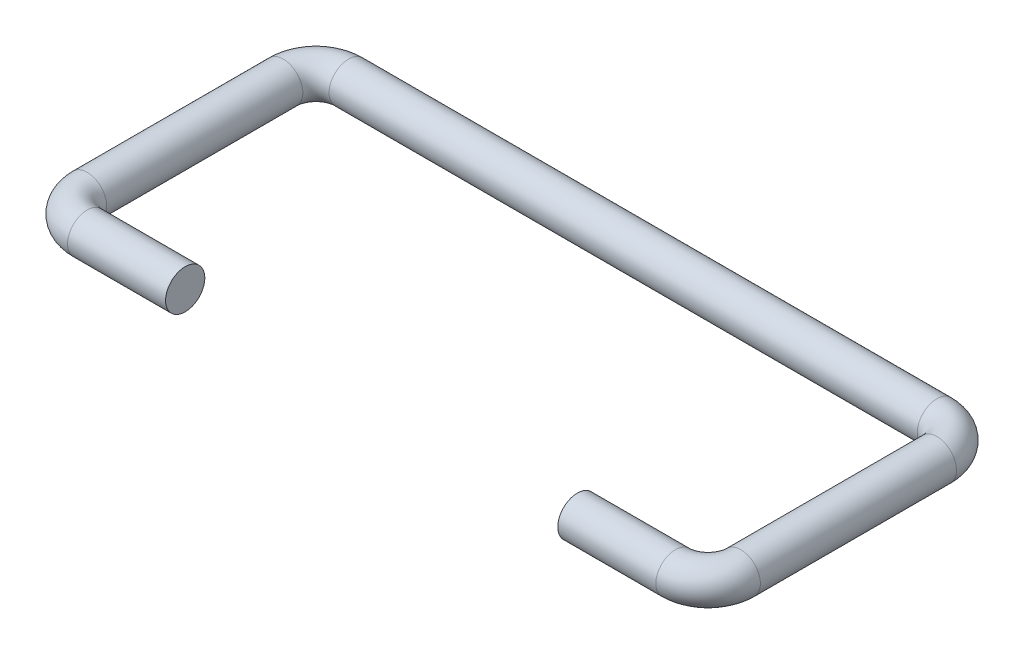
ISO-10303-21;
HEADER;
FILE_DESCRIPTION(('STEP AP214'),'2;1');
FILE_NAME('part.step','',(''),(''),'','','');
FILE_SCHEMA(('AUTOMOTIVE_DESIGN { 1 0 10303 214 1 1 1 1 }'));
ENDSEC;
DATA;
#1=APPLICATION_CONTEXT('core data for automotive mechanical design processes');
#2=APPLICATION_PROTOCOL_DEFINITION('international standard','automotive_design',2000,#1);
#3=PRODUCT_CONTEXT('',#1,'mechanical');
#4=PRODUCT('Part','Part','',(#3));
#5=PRODUCT_RELATED_PRODUCT_CATEGORY('part','',(#4));
#6=PRODUCT_DEFINITION_FORMATION('','',#4);
#7=PRODUCT_DEFINITION_CONTEXT('part definition',#1,'design');
#8=PRODUCT_DEFINITION('design','',#6,#7);
#9=PRODUCT_DEFINITION_SHAPE('','',#8);
#10=(LENGTH_UNIT() NAMED_UNIT(*) SI_UNIT(.MILLI.,.METRE.));
#11=(NAMED_UNIT(*) PLANE_ANGLE_UNIT() SI_UNIT($,.RADIAN.));
#12=(NAMED_UNIT(*) SI_UNIT($,.STERADIAN.) SOLID_ANGLE_UNIT());
#13=UNCERTAINTY_MEASURE_WITH_UNIT(LENGTH_MEASURE(1.E-05),#10,'distance_accuracy_value','');
#14=(GEOMETRIC_REPRESENTATION_CONTEXT(3) GLOBAL_UNCERTAINTY_ASSIGNED_CONTEXT((#13)) GLOBAL_UNIT_ASSIGNED_CONTEXT((#10,
#11,#12)) REPRESENTATION_CONTEXT('',''));
#15=CARTESIAN_POINT('',(0.,0.,0.));
#16=DIRECTION('',(0.,0.,1.));
#17=DIRECTION('',(1.,0.,0.));
#18=AXIS2_PLACEMENT_3D('',#15,#16,#17);
#19=CARTESIAN_POINT('',(45.,0.,0.));
#20=DIRECTION('',(-1.,0.,0.));
#21=DIRECTION('',(0.,0.,1.));
#22=AXIS2_PLACEMENT_3D('',#19,#20,#21);
#23=CYLINDRICAL_SURFACE('',#22,3.);
#24=CARTESIAN_POINT('',(-30.,0.,0.));
#25=DIRECTION('',(-1.,0.,0.));
#26=DIRECTION('',(0.,0.,1.));
#27=AXIS2_PLACEMENT_3D('',#24,#25,#26);
#28=CIRCLE('',#27,3.);
#29=CARTESIAN_POINT('',(-30.,0.,3.));
#30=VERTEX_POINT('',#29);
#31=EDGE_CURVE('E37',#30,#30,#28,.T.);
#32=ORIENTED_EDGE('',*,*,#31,.T.);
#33=EDGE_LOOP('',(#32));
#34=FACE_BOUND('',#33,.T.);
#35=CARTESIAN_POINT('',(-45.,0.,0.));
#36=DIRECTION('',(1.,0.,0.));
#37=DIRECTION('',(0.,0.,-1.));
#38=AXIS2_PLACEMENT_3D('',#35,#36,#37);
#39=CIRCLE('',#38,3.);
#40=CARTESIAN_POINT('',(-45.,0.,3.));
#41=VERTEX_POINT('',#40);
#42=EDGE_CURVE('E10',#41,#41,#39,.T.);
#43=ORIENTED_EDGE('',*,*,#42,.T.);
#44=EDGE_LOOP('',(#43));
#45=FACE_BOUND('',#44,.T.);
#46=ADVANCED_FACE('F33',(#34,#45),#23,.T.);
#47=CARTESIAN_POINT('',(-45.,0.,-5.));
#48=DIRECTION('',(0.,1.,0.));
#49=DIRECTION('',(0.,0.,1.));
#50=AXIS2_PLACEMENT_3D('',#47,#48,#49);
#51=TOROIDAL_SURFACE('',#50,5.,3.);
#52=CARTESIAN_POINT('',(-50.,0.,-5.00000000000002));
#53=DIRECTION('',(0.,0.,1.));
#54=DIRECTION('',(1.,0.,0.));
#55=AXIS2_PLACEMENT_3D('',#52,#53,#54);
#56=CIRCLE('',#55,3.);
#57=CARTESIAN_POINT('',(-53.,0.,-5.00000000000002));
#58=VERTEX_POINT('',#57);
#59=EDGE_CURVE('E41',#58,#58,#56,.T.);
#60=CARTESIAN_POINT('',(-45.,0.,-5.));
#61=DIRECTION('',(0.,1.,0.));
#62=DIRECTION('',(0.,0.,1.));
#63=AXIS2_PLACEMENT_3D('',#60,#61,#62);
#64=CIRCLE('',#63,8.);
#65=EDGE_CURVE('',#58,#41,#64,.T.);
#66=ORIENTED_EDGE('',*,*,#59,.T.);
#67=ORIENTED_EDGE('',*,*,#42,.F.);
#68=ORIENTED_EDGE('',*,*,#65,.T.);
#69=ORIENTED_EDGE('',*,*,#65,.F.);
#70=EDGE_LOOP('',(#66,#68,#67,#69));
#71=FACE_BOUND('',#70,.T.);
#72=ADVANCED_FACE('F35',(#71),#51,.T.);
#73=CARTESIAN_POINT('',(-50.,0.,-35.));
#74=DIRECTION('',(0.,0.,1.));
#75=DIRECTION('',(1.,0.,0.));
#76=AXIS2_PLACEMENT_3D('',#73,#74,#75);
#77=CYLINDRICAL_SURFACE('',#76,3.);
#78=CARTESIAN_POINT('',(-50.,0.,-35.));
#79=DIRECTION('',(0.,0.,1.));
#80=DIRECTION('',(1.,0.,0.));
#81=AXIS2_PLACEMENT_3D('',#78,#79,#80);
#82=CIRCLE('',#81,3.);
#83=CARTESIAN_POINT('',(-53.,0.,-35.));
#84=VERTEX_POINT('',#83);
#85=EDGE_CURVE('E46',#84,#84,#82,.T.);
#86=ORIENTED_EDGE('',*,*,#85,.T.);
#87=EDGE_LOOP('',(#86));
#88=FACE_BOUND('',#87,.T.);
#89=ORIENTED_EDGE('',*,*,#59,.F.);
#90=EDGE_LOOP('',(#89));
#91=FACE_BOUND('',#90,.T.);
#92=ADVANCED_FACE('F76',(#88,#91),#77,.T.);
#93=CARTESIAN_POINT('',(-45.,0.,-35.));
#94=DIRECTION('',(0.,1.,0.));
#95=DIRECTION('',(0.,0.,1.));
#96=AXIS2_PLACEMENT_3D('',#93,#94,#95);
#97=TOROIDAL_SURFACE('',#96,5.00000000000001,3.);
#98=CARTESIAN_POINT('',(-45.,0.,-40.));
#99=DIRECTION('',(-1.,0.,0.));
#100=DIRECTION('',(0.,0.,1.));
#101=AXIS2_PLACEMENT_3D('',#98,#99,#100);
#102=CIRCLE('',#101,3.);
#103=CARTESIAN_POINT('',(-45.,0.,-43.));
#104=VERTEX_POINT('',#103);
#105=EDGE_CURVE('E71',#104,#104,#102,.T.);
#106=CARTESIAN_POINT('',(-45.,0.,-35.));
#107=DIRECTION('',(0.,1.,0.));
#108=DIRECTION('',(0.,0.,1.));
#109=AXIS2_PLACEMENT_3D('',#106,#107,#108);
#110=CIRCLE('',#109,8.00000000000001);
#111=EDGE_CURVE('',#104,#84,#110,.T.);
#112=ORIENTED_EDGE('',*,*,#105,.T.);
#113=ORIENTED_EDGE('',*,*,#85,.F.);
#114=ORIENTED_EDGE('',*,*,#111,.T.);
#115=ORIENTED_EDGE('',*,*,#111,.F.);
#116=EDGE_LOOP('',(#112,#114,#113,#115));
#117=FACE_BOUND('',#116,.T.);
#118=ADVANCED_FACE('F79',(#117),#97,.T.);
#119=CARTESIAN_POINT('',(45.,0.,-40.));
#120=DIRECTION('',(-1.,0.,0.));
#121=DIRECTION('',(0.,0.,1.));
#122=AXIS2_PLACEMENT_3D('',#119,#120,#121);
#123=CYLINDRICAL_SURFACE('',#122,3.);
#124=CARTESIAN_POINT('',(45.,0.,-40.));
#125=DIRECTION('',(-1.,0.,0.));
#126=DIRECTION('',(0.,0.,1.));
#127=AXIS2_PLACEMENT_3D('',#124,#125,#126);
#128=CIRCLE('',#127,3.);
#129=CARTESIAN_POINT('',(45.,0.,-43.));
#130=VERTEX_POINT('',#129);
#131=EDGE_CURVE('E68',#130,#130,#128,.T.);
#132=ORIENTED_EDGE('',*,*,#131,.T.);
#133=EDGE_LOOP('',(#132));
#134=FACE_BOUND('',#133,.T.);
#135=ORIENTED_EDGE('',*,*,#105,.F.);
#136=EDGE_LOOP('',(#135));
#137=FACE_BOUND('',#136,.T.);
#138=ADVANCED_FACE('F81',(#134,#137),#123,.T.);
#139=CARTESIAN_POINT('',(45.,0.,-35.));
#140=DIRECTION('',(0.,1.,0.));
#141=DIRECTION('',(0.,0.,1.));
#142=AXIS2_PLACEMENT_3D('',#139,#140,#141);
#143=TOROIDAL_SURFACE('',#142,5.,3.);
#144=CARTESIAN_POINT('',(50.,0.,-35.));
#145=DIRECTION('',(0.,0.,-1.));
#146=DIRECTION('',(-1.,0.,0.));
#147=AXIS2_PLACEMENT_3D('',#144,#145,#146);
#148=CIRCLE('',#147,3.);
#149=CARTESIAN_POINT('',(53.,0.,-35.));
#150=VERTEX_POINT('',#149);
#151=EDGE_CURVE('E63',#150,#150,#148,.T.);
#152=CARTESIAN_POINT('',(45.,0.,-35.));
#153=DIRECTION('',(0.,1.,0.));
#154=DIRECTION('',(0.,0.,1.));
#155=AXIS2_PLACEMENT_3D('',#152,#153,#154);
#156=CIRCLE('',#155,8.00000000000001);
#157=EDGE_CURVE('',#150,#130,#156,.T.);
#158=ORIENTED_EDGE('',*,*,#151,.T.);
#159=ORIENTED_EDGE('',*,*,#131,.F.);
#160=ORIENTED_EDGE('',*,*,#157,.T.);
#161=ORIENTED_EDGE('',*,*,#157,.F.);
#162=EDGE_LOOP('',(#158,#160,#159,#161));
#163=FACE_BOUND('',#162,.T.);
#164=ADVANCED_FACE('F88',(#163),#143,.T.);
#165=CARTESIAN_POINT('',(50.,0.,-5.));
#166=DIRECTION('',(0.,0.,-1.));
#167=DIRECTION('',(-1.,0.,0.));
#168=AXIS2_PLACEMENT_3D('',#165,#166,#167);
#169=CYLINDRICAL_SURFACE('',#168,3.);
#170=CARTESIAN_POINT('',(50.,0.,-5.));
#171=DIRECTION('',(0.,0.,-1.));
#172=DIRECTION('',(-1.,0.,0.));
#173=AXIS2_PLACEMENT_3D('',#170,#171,#172);
#174=CIRCLE('',#173,3.);
#175=CARTESIAN_POINT('',(53.,0.,-5.));
#176=VERTEX_POINT('',#175);
#177=EDGE_CURVE('E58',#176,#176,#174,.T.);
#178=ORIENTED_EDGE('',*,*,#177,.T.);
#179=EDGE_LOOP('',(#178));
#180=FACE_BOUND('',#179,.T.);
#181=ORIENTED_EDGE('',*,*,#151,.F.);
#182=EDGE_LOOP('',(#181));
#183=FACE_BOUND('',#182,.T.);
#184=ADVANCED_FACE('F110',(#180,#183),#169,.T.);
#185=CARTESIAN_POINT('',(45.,0.,-5.));
#186=DIRECTION('',(0.,1.,0.));
#187=DIRECTION('',(0.,0.,1.));
#188=AXIS2_PLACEMENT_3D('',#185,#186,#187);
#189=TOROIDAL_SURFACE('',#188,5.,3.);
#190=CARTESIAN_POINT('',(45.,0.,0.));
#191=DIRECTION('',(1.,0.,0.));
#192=DIRECTION('',(0.,0.,-1.));
#193=AXIS2_PLACEMENT_3D('',#190,#191,#192);
#194=CIRCLE('',#193,3.);
#195=CARTESIAN_POINT('',(45.,0.,3.));
#196=VERTEX_POINT('',#195);
#197=EDGE_CURVE('E54',#196,#196,#194,.T.);
#198=CARTESIAN_POINT('',(45.,0.,-5.));
#199=DIRECTION('',(0.,1.,0.));
#200=DIRECTION('',(0.,0.,1.));
#201=AXIS2_PLACEMENT_3D('',#198,#199,#200);
#202=CIRCLE('',#201,8.);
#203=EDGE_CURVE('',#196,#176,#202,.T.);
#204=ORIENTED_EDGE('',*,*,#197,.T.);
#205=ORIENTED_EDGE('',*,*,#177,.F.);
#206=ORIENTED_EDGE('',*,*,#203,.T.);
#207=ORIENTED_EDGE('',*,*,#203,.F.);
#208=EDGE_LOOP('',(#204,#206,#205,#207));
#209=FACE_BOUND('',#208,.T.);
#210=ADVANCED_FACE('F102',(#209),#189,.T.);
#211=CARTESIAN_POINT('',(30.,0.,0.));
#212=DIRECTION('',(1.,0.,0.));
#213=DIRECTION('',(0.,0.,-1.));
#214=AXIS2_PLACEMENT_3D('',#211,#212,#213);
#215=CIRCLE('',#214,3.);
#216=CARTESIAN_POINT('',(30.,0.,-3.));
#217=VERTEX_POINT('',#216);
#218=EDGE_CURVE('E49',#217,#217,#215,.T.);
#219=ORIENTED_EDGE('',*,*,#218,.T.);
#220=EDGE_LOOP('',(#219));
#221=FACE_BOUND('',#220,.T.);
#222=ORIENTED_EDGE('',*,*,#197,.F.);
#223=EDGE_LOOP('',(#222));
#224=FACE_BOUND('',#223,.T.);
#225=ADVANCED_FACE('F93',(#221,#224),#23,.T.);
#226=CARTESIAN_POINT('',(30.,-5.,-4.99999999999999));
#227=DIRECTION('',(1.,0.,0.));
#228=DIRECTION('',(0.,0.,-1.));
#229=AXIS2_PLACEMENT_3D('',#226,#227,#228);
#230=PLANE('',#229);
#231=ORIENTED_EDGE('',*,*,#218,.F.);
#232=EDGE_LOOP('',(#231));
#233=FACE_BOUND('',#232,.T.);
#234=ADVANCED_FACE('F101',(#233),#230,.F.);
#235=CARTESIAN_POINT('',(-30.,-5.,-4.99999999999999));
#236=DIRECTION('',(-1.,0.,0.));
#237=DIRECTION('',(0.,0.,1.));
#238=AXIS2_PLACEMENT_3D('',#235,#236,#237);
#239=PLANE('',#238);
#240=ORIENTED_EDGE('',*,*,#31,.F.);
#241=EDGE_LOOP('',(#240));
#242=FACE_BOUND('',#241,.T.);
#243=ADVANCED_FACE('F107',(#242),#239,.F.);
#244=CLOSED_SHELL('',(#46,#72,#92,#118,#138,#164,#184,#210,#225,#234,#243));
#245=MANIFOLD_SOLID_BREP('B2',#244);
#246=ADVANCED_BREP_SHAPE_REPRESENTATION('',(#18,#245),#14);
#247=SHAPE_DEFINITION_REPRESENTATION(#9,#246);
ENDSEC;
END-ISO-10303-21;
